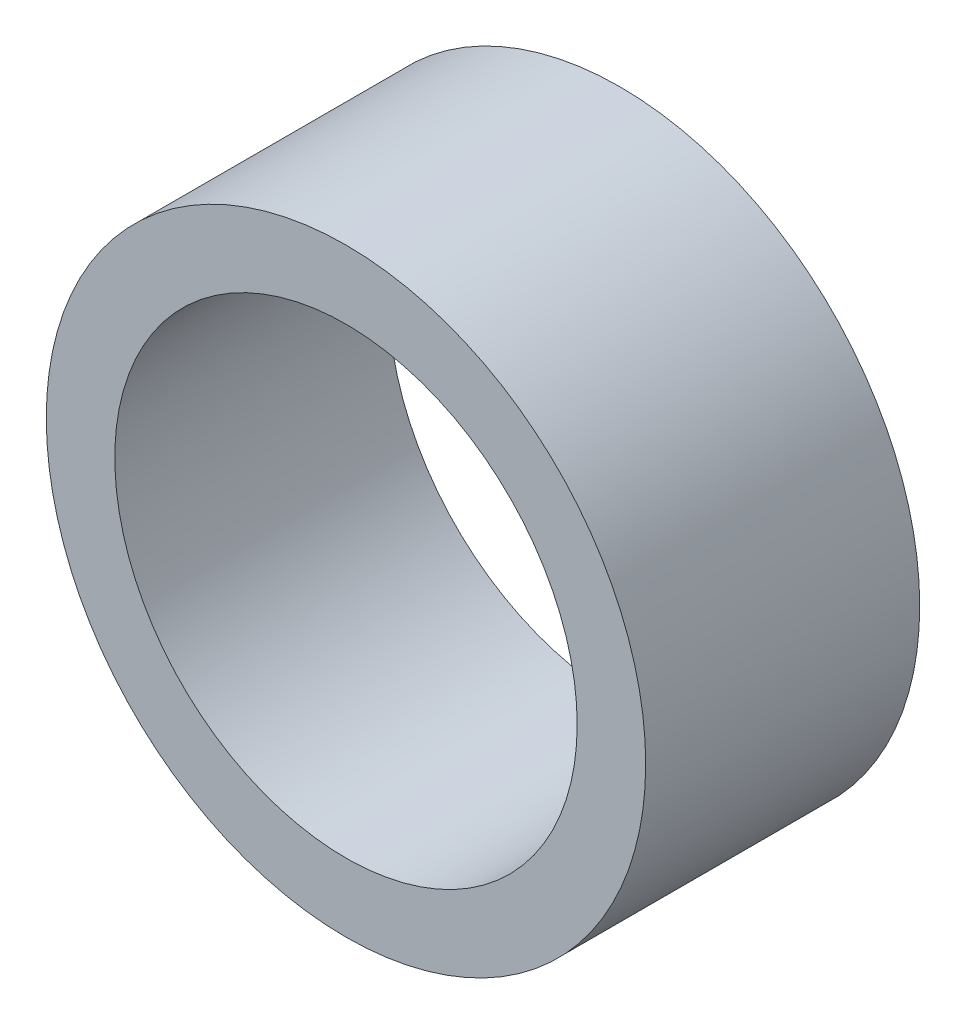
from build123d import *

# Parameters (mm, degrees)
ESQUISSE1_R             = 17.5
BASE_EXTRUSION_DEPTH    = 16
ESQUISSE2_R             = 13.5
ENL_V_MAT_EXTRU_1_DEPTH = 30


with BuildPart() as part:
    # Esquisse1 → Base-Extrusion (new body)
    with BuildSketch(Plane.XY):
        Circle(ESQUISSE1_R)
    extrude(amount=BASE_EXTRUSION_DEPTH)

    # Esquisse2 → Enl_v. mat.-Extru.1 (cut)
    with BuildSketch(Plane.XY.offset(16)):
        Circle(ESQUISSE2_R)
    extrude(amount=-ENL_V_MAT_EXTRU_1_DEPTH, mode=Mode.SUBTRACT)


solid = part.part
